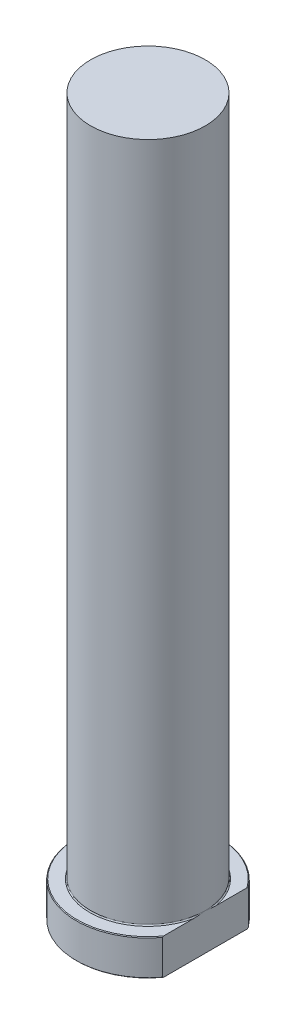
from build123d import *
from build123d.topology import SkipClean

# Parameters (mm, degrees)
CHAMFER1_SIZE = 0.2
FILLET1_R     = 0.3
KEY_DEPTH     = 202.990098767


with BuildPart() as part:
    # Sketch1 → Revolve1 (revolve)
    with BuildSketch(Plane.XY, mode=Mode.PRIVATE) as revolve1_sk:
        Polygon((0, 0), (-20, 0), (-20, 10), (-16, 10), (-16, 200), (0, 200), align=None)
    revolve(revolve1_sk.sketch.rotate(Axis((0, 259.958771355, 0), (0, -1, 0)), 270), axis=Axis((0, 259.958771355, 0), (0, -1, 0)))

    # Chamfer1
    chamfer1_edges = [part.edges().sort_by_distance(p)[0] for p in [
        (0, 10, -20),
        (0, 0, -20),
    ]]
    chamfer(chamfer1_edges, length=CHAMFER1_SIZE)

    # Fillet1
    fillet1_edges = [part.edges().sort_by_distance(p)[0] for p in [
        (0, 10, -16),
    ]]
    fillet(fillet1_edges, radius=FILLET1_R)

    # Sketch2 → KEY (cut, through all)
    with SkipClean():  # the faces are left unmerged after this step: merging them gives an invalid solid
        with BuildSketch(Plane(origin=(0, 0, 0), x_dir=(1, 0, 0), z_dir=(0, 1, 0))):
            with BuildLine():
                Line((16, 12), (16, -12))
                ThreePointArc((16, -12), (20, 0), (16, 12))
            make_face()
        extrude(amount=KEY_DEPTH, mode=Mode.SUBTRACT)


solid = part.part
